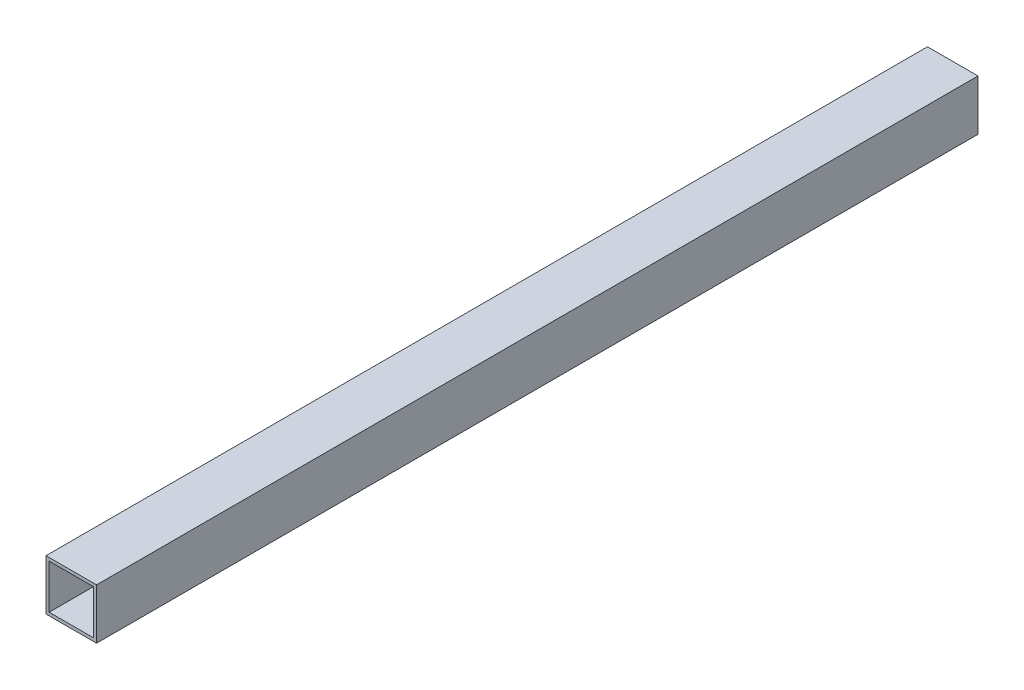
ISO-10303-21;
HEADER;
FILE_DESCRIPTION(('STEP AP214'),'2;1');
FILE_NAME('part.step','',(''),(''),'','','');
FILE_SCHEMA(('AUTOMOTIVE_DESIGN { 1 0 10303 214 1 1 1 1 }'));
ENDSEC;
DATA;
#1=APPLICATION_CONTEXT('core data for automotive mechanical design processes');
#2=APPLICATION_PROTOCOL_DEFINITION('international standard','automotive_design',2000,#1);
#3=PRODUCT_CONTEXT('',#1,'mechanical');
#4=PRODUCT('Part','Part','',(#3));
#5=PRODUCT_RELATED_PRODUCT_CATEGORY('part','',(#4));
#6=PRODUCT_DEFINITION_FORMATION('','',#4);
#7=PRODUCT_DEFINITION_CONTEXT('part definition',#1,'design');
#8=PRODUCT_DEFINITION('design','',#6,#7);
#9=PRODUCT_DEFINITION_SHAPE('','',#8);
#10=(LENGTH_UNIT() NAMED_UNIT(*) SI_UNIT(.MILLI.,.METRE.));
#11=(NAMED_UNIT(*) PLANE_ANGLE_UNIT() SI_UNIT($,.RADIAN.));
#12=(NAMED_UNIT(*) SI_UNIT($,.STERADIAN.) SOLID_ANGLE_UNIT());
#13=UNCERTAINTY_MEASURE_WITH_UNIT(LENGTH_MEASURE(1.E-05),#10,'distance_accuracy_value','');
#14=(GEOMETRIC_REPRESENTATION_CONTEXT(3) GLOBAL_UNCERTAINTY_ASSIGNED_CONTEXT((#13)) GLOBAL_UNIT_ASSIGNED_CONTEXT((#10,
#11,#12)) REPRESENTATION_CONTEXT('',''));
#15=CARTESIAN_POINT('',(0.,0.,0.));
#16=DIRECTION('',(0.,0.,1.));
#17=DIRECTION('',(1.,0.,0.));
#18=AXIS2_PLACEMENT_3D('',#15,#16,#17);
#19=CARTESIAN_POINT('',(-25.4,-25.4,-94.067048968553));
#20=DIRECTION('',(0.,-1.,0.));
#21=DIRECTION('',(0.,0.,-1.));
#22=AXIS2_PLACEMENT_3D('',#19,#20,#21);
#23=PLANE('',#22);
#24=DIRECTION('',(0.,0.,1.));
#25=VECTOR('',#24,1.);
#26=CARTESIAN_POINT('',(-25.4,-25.4,-94.067048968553));
#27=LINE('',#26,#25);
#28=CARTESIAN_POINT('',(-25.4,-25.4,-22.2249999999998));
#29=VERTEX_POINT('',#28);
#30=CARTESIAN_POINT('',(-25.4,-25.4,863.6));
#31=VERTEX_POINT('',#30);
#32=EDGE_CURVE('E125',#29,#31,#27,.T.);
#33=ORIENTED_EDGE('',*,*,#32,.F.);
#34=DIRECTION('',(1.,0.,0.));
#35=VECTOR('',#34,1.);
#36=CARTESIAN_POINT('',(-25.4,-25.4,-22.2249999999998));
#37=LINE('',#36,#35);
#38=CARTESIAN_POINT('',(25.4,-25.4,-22.2249999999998));
#39=VERTEX_POINT('',#38);
#40=EDGE_CURVE('E119',#29,#39,#37,.T.);
#41=ORIENTED_EDGE('',*,*,#40,.T.);
#42=DIRECTION('',(0.,0.,1.));
#43=VECTOR('',#42,1.);
#44=CARTESIAN_POINT('',(25.4,-25.4,-94.067048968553));
#45=LINE('',#44,#43);
#46=CARTESIAN_POINT('',(25.4,-25.4,863.6));
#47=VERTEX_POINT('',#46);
#48=EDGE_CURVE('E121',#39,#47,#45,.T.);
#49=ORIENTED_EDGE('',*,*,#48,.T.);
#50=DIRECTION('',(1.,0.,0.));
#51=VECTOR('',#50,1.);
#52=CARTESIAN_POINT('',(-25.4,-25.4,863.6));
#53=LINE('',#52,#51);
#54=EDGE_CURVE('E147',#31,#47,#53,.T.);
#55=ORIENTED_EDGE('',*,*,#54,.F.);
#56=EDGE_LOOP('',(#33,#41,#49,#55));
#57=FACE_BOUND('',#56,.T.);
#58=ADVANCED_FACE('F31',(#57),#23,.T.);
#59=CARTESIAN_POINT('',(-25.4,25.4,-94.067048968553));
#60=DIRECTION('',(-1.,0.,0.));
#61=DIRECTION('',(0.,0.,1.));
#62=AXIS2_PLACEMENT_3D('',#59,#60,#61);
#63=PLANE('',#62);
#64=DIRECTION('',(0.,0.,1.));
#65=VECTOR('',#64,1.);
#66=CARTESIAN_POINT('',(-25.4,25.4,-94.067048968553));
#67=LINE('',#66,#65);
#68=CARTESIAN_POINT('',(-25.4,25.4,-22.2249999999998));
#69=VERTEX_POINT('',#68);
#70=CARTESIAN_POINT('',(-25.4,25.4,863.6));
#71=VERTEX_POINT('',#70);
#72=EDGE_CURVE('E128',#69,#71,#67,.T.);
#73=ORIENTED_EDGE('',*,*,#72,.F.);
#74=DIRECTION('',(0.,-1.,0.));
#75=VECTOR('',#74,1.);
#76=CARTESIAN_POINT('',(-25.4,25.4,-22.2249999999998));
#77=LINE('',#76,#75);
#78=EDGE_CURVE('E122',#69,#29,#77,.T.);
#79=ORIENTED_EDGE('',*,*,#78,.T.);
#80=ORIENTED_EDGE('',*,*,#32,.T.);
#81=DIRECTION('',(0.,-1.,0.));
#82=VECTOR('',#81,1.);
#83=CARTESIAN_POINT('',(-25.4,25.4,863.6));
#84=LINE('',#83,#82);
#85=EDGE_CURVE('E114',#71,#31,#84,.T.);
#86=ORIENTED_EDGE('',*,*,#85,.F.);
#87=EDGE_LOOP('',(#73,#79,#80,#86));
#88=FACE_BOUND('',#87,.T.);
#89=ADVANCED_FACE('F167',(#88),#63,.T.);
#90=CARTESIAN_POINT('',(25.4,25.4,-94.067048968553));
#91=DIRECTION('',(0.,1.,0.));
#92=DIRECTION('',(0.,0.,1.));
#93=AXIS2_PLACEMENT_3D('',#90,#91,#92);
#94=PLANE('',#93);
#95=DIRECTION('',(0.,0.,1.));
#96=VECTOR('',#95,1.);
#97=CARTESIAN_POINT('',(25.4,25.4,-94.067048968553));
#98=LINE('',#97,#96);
#99=CARTESIAN_POINT('',(25.4,25.4,-22.2249999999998));
#100=VERTEX_POINT('',#99);
#101=CARTESIAN_POINT('',(25.4,25.4,863.6));
#102=VERTEX_POINT('',#101);
#103=EDGE_CURVE('E132',#100,#102,#98,.T.);
#104=ORIENTED_EDGE('',*,*,#103,.F.);
#105=DIRECTION('',(-1.,0.,0.));
#106=VECTOR('',#105,1.);
#107=CARTESIAN_POINT('',(25.4,25.4,-22.2249999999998));
#108=LINE('',#107,#106);
#109=EDGE_CURVE('E126',#100,#69,#108,.T.);
#110=ORIENTED_EDGE('',*,*,#109,.T.);
#111=ORIENTED_EDGE('',*,*,#72,.T.);
#112=DIRECTION('',(-1.,0.,0.));
#113=VECTOR('',#112,1.);
#114=CARTESIAN_POINT('',(25.4,25.4,863.6));
#115=LINE('',#114,#113);
#116=EDGE_CURVE('E157',#102,#71,#115,.T.);
#117=ORIENTED_EDGE('',*,*,#116,.F.);
#118=EDGE_LOOP('',(#104,#110,#111,#117));
#119=FACE_BOUND('',#118,.T.);
#120=ADVANCED_FACE('F175',(#119),#94,.T.);
#121=CARTESIAN_POINT('',(25.4,-25.4,-94.067048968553));
#122=DIRECTION('',(1.,0.,0.));
#123=DIRECTION('',(0.,0.,-1.));
#124=AXIS2_PLACEMENT_3D('',#121,#122,#123);
#125=PLANE('',#124);
#126=ORIENTED_EDGE('',*,*,#48,.F.);
#127=DIRECTION('',(0.,1.,0.));
#128=VECTOR('',#127,1.);
#129=CARTESIAN_POINT('',(25.4,-25.4,-22.2249999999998));
#130=LINE('',#129,#128);
#131=EDGE_CURVE('E49',#39,#100,#130,.T.);
#132=ORIENTED_EDGE('',*,*,#131,.T.);
#133=ORIENTED_EDGE('',*,*,#103,.T.);
#134=DIRECTION('',(0.,1.,0.));
#135=VECTOR('',#134,1.);
#136=CARTESIAN_POINT('',(25.4,-25.4,863.6));
#137=LINE('',#136,#135);
#138=EDGE_CURVE('E152',#47,#102,#137,.T.);
#139=ORIENTED_EDGE('',*,*,#138,.F.);
#140=EDGE_LOOP('',(#126,#132,#133,#139));
#141=FACE_BOUND('',#140,.T.);
#142=ADVANCED_FACE('F172',(#141),#125,.T.);
#143=CARTESIAN_POINT('',(-22.225,22.225,-94.067048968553));
#144=DIRECTION('',(0.,1.,0.));
#145=DIRECTION('',(0.,0.,1.));
#146=AXIS2_PLACEMENT_3D('',#143,#144,#145);
#147=PLANE('',#146);
#148=DIRECTION('',(-1.,0.,0.));
#149=VECTOR('',#148,1.);
#150=CARTESIAN_POINT('',(-22.225,22.225,-22.2249999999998));
#151=LINE('',#150,#149);
#152=CARTESIAN_POINT('',(22.225,22.225,-22.2249999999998));
#153=VERTEX_POINT('',#152);
#154=CARTESIAN_POINT('',(-22.225,22.225,-22.2249999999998));
#155=VERTEX_POINT('',#154);
#156=EDGE_CURVE('E95',#153,#155,#151,.T.);
#157=ORIENTED_EDGE('',*,*,#156,.F.);
#158=DIRECTION('',(0.,0.,1.));
#159=VECTOR('',#158,1.);
#160=CARTESIAN_POINT('',(22.225,22.225,-94.067048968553));
#161=LINE('',#160,#159);
#162=CARTESIAN_POINT('',(22.225,22.225,863.6));
#163=VERTEX_POINT('',#162);
#164=EDGE_CURVE('E134',#153,#163,#161,.T.);
#165=ORIENTED_EDGE('',*,*,#164,.T.);
#166=DIRECTION('',(-1.,0.,0.));
#167=VECTOR('',#166,1.);
#168=CARTESIAN_POINT('',(-22.225,22.225,863.6));
#169=LINE('',#168,#167);
#170=CARTESIAN_POINT('',(-22.225,22.225,863.6));
#171=VERTEX_POINT('',#170);
#172=EDGE_CURVE('E98',#163,#171,#169,.T.);
#173=ORIENTED_EDGE('',*,*,#172,.T.);
#174=DIRECTION('',(0.,0.,1.));
#175=VECTOR('',#174,1.);
#176=CARTESIAN_POINT('',(-22.225,22.225,-94.067048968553));
#177=LINE('',#176,#175);
#178=EDGE_CURVE('E35',#155,#171,#177,.T.);
#179=ORIENTED_EDGE('',*,*,#178,.F.);
#180=EDGE_LOOP('',(#157,#165,#173,#179));
#181=FACE_BOUND('',#180,.T.);
#182=ADVANCED_FACE('F93',(#181),#147,.F.);
#183=CARTESIAN_POINT('',(22.225,22.225,-94.067048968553));
#184=DIRECTION('',(1.,0.,0.));
#185=DIRECTION('',(0.,0.,-1.));
#186=AXIS2_PLACEMENT_3D('',#183,#184,#185);
#187=PLANE('',#186);
#188=DIRECTION('',(0.,1.,0.));
#189=VECTOR('',#188,1.);
#190=CARTESIAN_POINT('',(22.225,22.225,-22.2249999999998));
#191=LINE('',#190,#189);
#192=CARTESIAN_POINT('',(22.225,-22.225,-22.2249999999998));
#193=VERTEX_POINT('',#192);
#194=EDGE_CURVE('E112',#193,#153,#191,.T.);
#195=ORIENTED_EDGE('',*,*,#194,.F.);
#196=DIRECTION('',(0.,0.,1.));
#197=VECTOR('',#196,1.);
#198=CARTESIAN_POINT('',(22.225,-22.225,-94.067048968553));
#199=LINE('',#198,#197);
#200=CARTESIAN_POINT('',(22.225,-22.225,863.6));
#201=VERTEX_POINT('',#200);
#202=EDGE_CURVE('E137',#193,#201,#199,.T.);
#203=ORIENTED_EDGE('',*,*,#202,.T.);
#204=DIRECTION('',(0.,1.,0.));
#205=VECTOR('',#204,1.);
#206=CARTESIAN_POINT('',(22.225,22.225,863.6));
#207=LINE('',#206,#205);
#208=EDGE_CURVE('E138',#201,#163,#207,.T.);
#209=ORIENTED_EDGE('',*,*,#208,.T.);
#210=ORIENTED_EDGE('',*,*,#164,.F.);
#211=EDGE_LOOP('',(#195,#203,#209,#210));
#212=FACE_BOUND('',#211,.T.);
#213=ADVANCED_FACE('F195',(#212),#187,.F.);
#214=CARTESIAN_POINT('',(22.225,-22.225,-94.067048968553));
#215=DIRECTION('',(0.,-1.,0.));
#216=DIRECTION('',(0.,0.,-1.));
#217=AXIS2_PLACEMENT_3D('',#214,#215,#216);
#218=PLANE('',#217);
#219=DIRECTION('',(1.,0.,0.));
#220=VECTOR('',#219,1.);
#221=CARTESIAN_POINT('',(22.225,-22.225,-22.2249999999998));
#222=LINE('',#221,#220);
#223=CARTESIAN_POINT('',(-22.225,-22.225,-22.2249999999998));
#224=VERTEX_POINT('',#223);
#225=EDGE_CURVE('E11',#224,#193,#222,.T.);
#226=ORIENTED_EDGE('',*,*,#225,.F.);
#227=DIRECTION('',(0.,0.,1.));
#228=VECTOR('',#227,1.);
#229=CARTESIAN_POINT('',(-22.225,-22.225,-94.067048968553));
#230=LINE('',#229,#228);
#231=CARTESIAN_POINT('',(-22.225,-22.225,863.6));
#232=VERTEX_POINT('',#231);
#233=EDGE_CURVE('E107',#224,#232,#230,.T.);
#234=ORIENTED_EDGE('',*,*,#233,.T.);
#235=DIRECTION('',(1.,0.,0.));
#236=VECTOR('',#235,1.);
#237=CARTESIAN_POINT('',(22.225,-22.225,863.6));
#238=LINE('',#237,#236);
#239=EDGE_CURVE('E103',#232,#201,#238,.T.);
#240=ORIENTED_EDGE('',*,*,#239,.T.);
#241=ORIENTED_EDGE('',*,*,#202,.F.);
#242=EDGE_LOOP('',(#226,#234,#240,#241));
#243=FACE_BOUND('',#242,.T.);
#244=ADVANCED_FACE('F192',(#243),#218,.F.);
#245=CARTESIAN_POINT('',(-22.225,-22.225,-94.067048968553));
#246=DIRECTION('',(-1.,0.,0.));
#247=DIRECTION('',(0.,0.,1.));
#248=AXIS2_PLACEMENT_3D('',#245,#246,#247);
#249=PLANE('',#248);
#250=DIRECTION('',(0.,-1.,0.));
#251=VECTOR('',#250,1.);
#252=CARTESIAN_POINT('',(-22.225,-22.225,-22.2249999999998));
#253=LINE('',#252,#251);
#254=EDGE_CURVE('E41',#155,#224,#253,.T.);
#255=ORIENTED_EDGE('',*,*,#254,.F.);
#256=ORIENTED_EDGE('',*,*,#178,.T.);
#257=DIRECTION('',(0.,-1.,0.));
#258=VECTOR('',#257,1.);
#259=CARTESIAN_POINT('',(-22.225,-22.225,863.6));
#260=LINE('',#259,#258);
#261=EDGE_CURVE('E102',#171,#232,#260,.T.);
#262=ORIENTED_EDGE('',*,*,#261,.T.);
#263=ORIENTED_EDGE('',*,*,#233,.F.);
#264=EDGE_LOOP('',(#255,#256,#262,#263));
#265=FACE_BOUND('',#264,.T.);
#266=ADVANCED_FACE('F106',(#265),#249,.F.);
#267=CARTESIAN_POINT('',(25.4,-25.4,863.6));
#268=DIRECTION('',(0.,0.,1.));
#269=DIRECTION('',(1.,0.,0.));
#270=AXIS2_PLACEMENT_3D('',#267,#268,#269);
#271=PLANE('',#270);
#272=ORIENTED_EDGE('',*,*,#172,.F.);
#273=ORIENTED_EDGE('',*,*,#208,.F.);
#274=ORIENTED_EDGE('',*,*,#239,.F.);
#275=ORIENTED_EDGE('',*,*,#261,.F.);
#276=EDGE_LOOP('',(#272,#273,#274,#275));
#277=FACE_BOUND('',#276,.T.);
#278=ORIENTED_EDGE('',*,*,#54,.T.);
#279=ORIENTED_EDGE('',*,*,#138,.T.);
#280=ORIENTED_EDGE('',*,*,#116,.T.);
#281=ORIENTED_EDGE('',*,*,#85,.T.);
#282=EDGE_LOOP('',(#278,#279,#280,#281));
#283=FACE_BOUND('',#282,.T.);
#284=ADVANCED_FACE('F163',(#277,#283),#271,.T.);
#285=CARTESIAN_POINT('',(1828.8,177.8,-22.2249999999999));
#286=DIRECTION('',(0.,0.,-1.));
#287=DIRECTION('',(0.,-1.,0.));
#288=AXIS2_PLACEMENT_3D('',#285,#286,#287);
#289=PLANE('',#288);
#290=ORIENTED_EDGE('',*,*,#40,.F.);
#291=ORIENTED_EDGE('',*,*,#78,.F.);
#292=ORIENTED_EDGE('',*,*,#109,.F.);
#293=ORIENTED_EDGE('',*,*,#131,.F.);
#294=EDGE_LOOP('',(#290,#291,#292,#293));
#295=FACE_BOUND('',#294,.T.);
#296=ORIENTED_EDGE('',*,*,#194,.T.);
#297=ORIENTED_EDGE('',*,*,#156,.T.);
#298=ORIENTED_EDGE('',*,*,#254,.T.);
#299=ORIENTED_EDGE('',*,*,#225,.T.);
#300=EDGE_LOOP('',(#296,#297,#298,#299));
#301=FACE_BOUND('',#300,.T.);
#302=ADVANCED_FACE('F33',(#295,#301),#289,.T.);
#303=CLOSED_SHELL('',(#58,#89,#120,#142,#182,#213,#244,#266,#284,#302));
#304=MANIFOLD_SOLID_BREP('B2',#303);
#305=ADVANCED_BREP_SHAPE_REPRESENTATION('',(#18,#304),#14);
#306=SHAPE_DEFINITION_REPRESENTATION(#9,#305);
ENDSEC;
END-ISO-10303-21;
